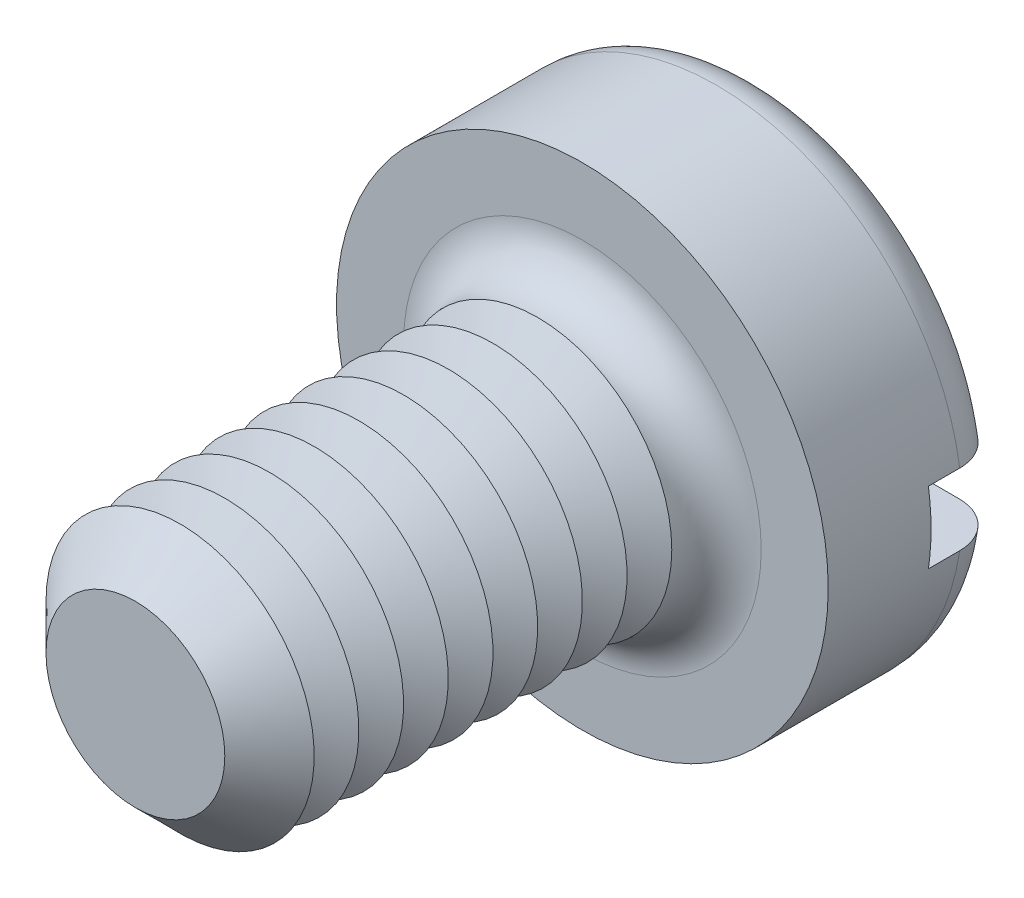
from build123d import *

# Parameters (mm, degrees)
SKETCH3_R           = 2.75
BOSS_EXTRUDE2_DEPTH = 2
SKETCH4_R           = 1.5
BOSS_EXTRUDE3_DEPTH = 5
FILLET1_R           = 0.5
CHAMFER1_SIZE       = 0.5
LPATTERN1_COUNT     = 8
LPATTERN1_PITCH     = 0.5
SKETCH8_W           = 5.5
SKETCH8_H           = 0.8
CUT_EXTRUDE1_DEPTH  = 0.85


with BuildPart() as part:
    # Sketch3 → Boss-Extrude2 (new body)
    with BuildSketch(Plane.XY):
        Circle(SKETCH3_R)
    extrude(amount=-BOSS_EXTRUDE2_DEPTH)

    # Sketch4 → Boss-Extrude3 (add)
    with BuildSketch(Plane.XY):
        Circle(SKETCH4_R)
    extrude(amount=BOSS_EXTRUDE3_DEPTH)

    # Fillet1
    fillet1_edges = [part.edges().sort_by_distance(p)[0] for p in [
        (-2.75, 0, -2),
        (-1.5, 0, 0),
    ]]
    fillet(fillet1_edges, radius=FILLET1_R)

    # Chamfer1
    chamfer1_edges = [part.edges().sort_by_distance(p)[0] for p in [
        (-1.5, 0, 5),
    ]]
    chamfer(chamfer1_edges, length=CHAMFER1_SIZE)

    # Sketch6 → Cut-Revolve1 (revolve, cut)
    with BuildSketch(Plane(origin=(0, 0, 0), x_dir=(0, 0, -1), z_dir=(1, 0, 0)), mode=Mode.PRIVATE) as cut_revolve1_sk:
        Polygon((-0.5, 1.5), (-0.75, 1.066987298), (-1, 1.5), align=None)
    cut_revolve1 = revolve(cut_revolve1_sk.sketch.rotate(Axis((0, 0, -1.694361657), (0, 0, 1)), 90), axis=Axis((0, 0, -1.694361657), (0, 0, 1)), mode=Mode.SUBTRACT)

    # LPattern1: Cut-Revolve1 ×8
    with Locations(*[(0, 0, i * LPATTERN1_PITCH) for i in range(1, LPATTERN1_COUNT)]):
        add(cut_revolve1, mode=Mode.SUBTRACT)

    # Sketch8 → Cut-Extrude1 (cut)
    with BuildSketch(Plane(origin=(0, 0, -2), x_dir=(-1, 0, 0), z_dir=(0, 0, -1))):
        Rectangle(SKETCH8_W, SKETCH8_H)
    extrude(amount=-CUT_EXTRUDE1_DEPTH, mode=Mode.SUBTRACT)


solid = part.part
